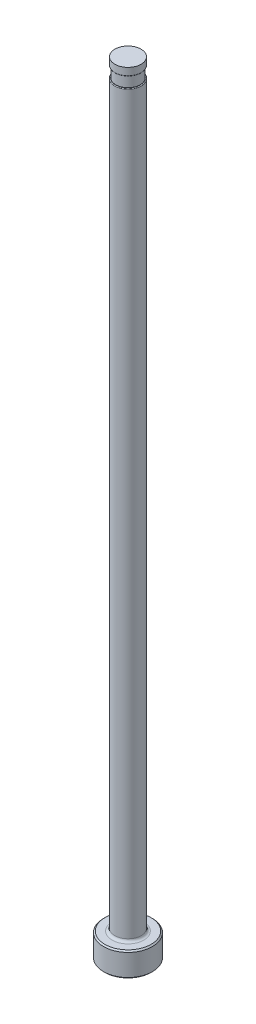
from build123d import *

# Parameters (mm, degrees)
CHAMFER1_SIZE     = 0.254
FILLET1_R         = 0.508
SKETCH2_W         = 0.2032
SKETCH2_H         = 2.032
D_SLOT_DEPTH      = 153.548755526
D_SLOT_DEPTH_BACK = 153.548755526
SKETCH5_W         = 0.0254
SKETCH5_H         = 1.524
FILLET2_R         = 0.127


with BuildPart() as part:
    # Sketch1 → Revolve1 (revolve)
    with BuildSketch(Plane.XY, mode=Mode.PRIVATE) as revolve1_sk:
        Polygon((0, 0), (-4.7625, 0), (-4.7625, 4.7498), (-2.57937, 4.7498), (-2.57937, 152.4), (0, 152.4), align=None)
    revolve(revolve1_sk.sketch.rotate(Axis((0, 259.958771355, 0), (0, -1, 0)), 270), axis=Axis((0, 259.958771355, 0), (0, -1, 0)))

    # Chamfer1
    chamfer1_edges = [part.edges().sort_by_distance(p)[0] for p in [
        (0, 4.7498, -4.7625),
        (0, 0, -4.7625),
    ]]
    chamfer(chamfer1_edges, length=CHAMFER1_SIZE)

    # Fillet1
    fillet1_edges = [part.edges().sort_by_distance(p)[0] for p in [
        (0, 4.7498, -2.57937),
    ]]
    fillet(fillet1_edges, radius=FILLET1_R)

    # Sketch2 → Vent Relief (revolve, cut)
    with BuildSketch(Plane.XY, mode=Mode.PRIVATE) as vent_relief_sk:
        with Locations((-2.47777, 149.86)):
            Rectangle(SKETCH2_W, SKETCH2_H)
    revolve(vent_relief_sk.sketch.rotate(Axis((0, 153.448281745, 0), (0, -1, 0)), 270), axis=Axis((0, 153.448281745, 0), (0, -1, 0)), mode=Mode.SUBTRACT)

    # Sketch3 → D-Slot (cut, two sides: drawn at the far end of the back side and taken through both)
    with BuildSketch(Plane.XY.offset(-D_SLOT_DEPTH_BACK)):
        with BuildLine():
            Line((-2.37617, 149.86), (-2.37617, 86.36))
            ThreePointArc((-2.37617, 86.36), (-2.427383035, 85.792038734), (-2.57937, 85.2424))
            Line((-2.57937, 85.2424), (-2.57937, 149.86))
            Line((-2.57937, 149.86), (-2.37617, 149.86))
        make_face()
    extrude(amount=D_SLOT_DEPTH + D_SLOT_DEPTH_BACK, mode=Mode.SUBTRACT)

    # Sketch5 → Vent Diameter (revolve, cut)
    with BuildSketch(Plane.XY, mode=Mode.PRIVATE) as vent_diameter_sk:
        with Locations((-2.56667, 151.638)):
            Rectangle(SKETCH5_W, SKETCH5_H)
    revolve(vent_diameter_sk.sketch.rotate(Axis((0, 152.687735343, 0), (0, -1, 0)), 90), axis=Axis((0, 152.687735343, 0), (0, -1, 0)), mode=Mode.SUBTRACT)

    # Fillet2
    fillet2_edges = [part.edges().sort_by_distance(p)[0] for p in [
        (2.149591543, 148.844, -1.425624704),
        (0, 150.876, 2.55397),
    ]]
    fillet(fillet2_edges, radius=FILLET2_R)


solid = part.part
